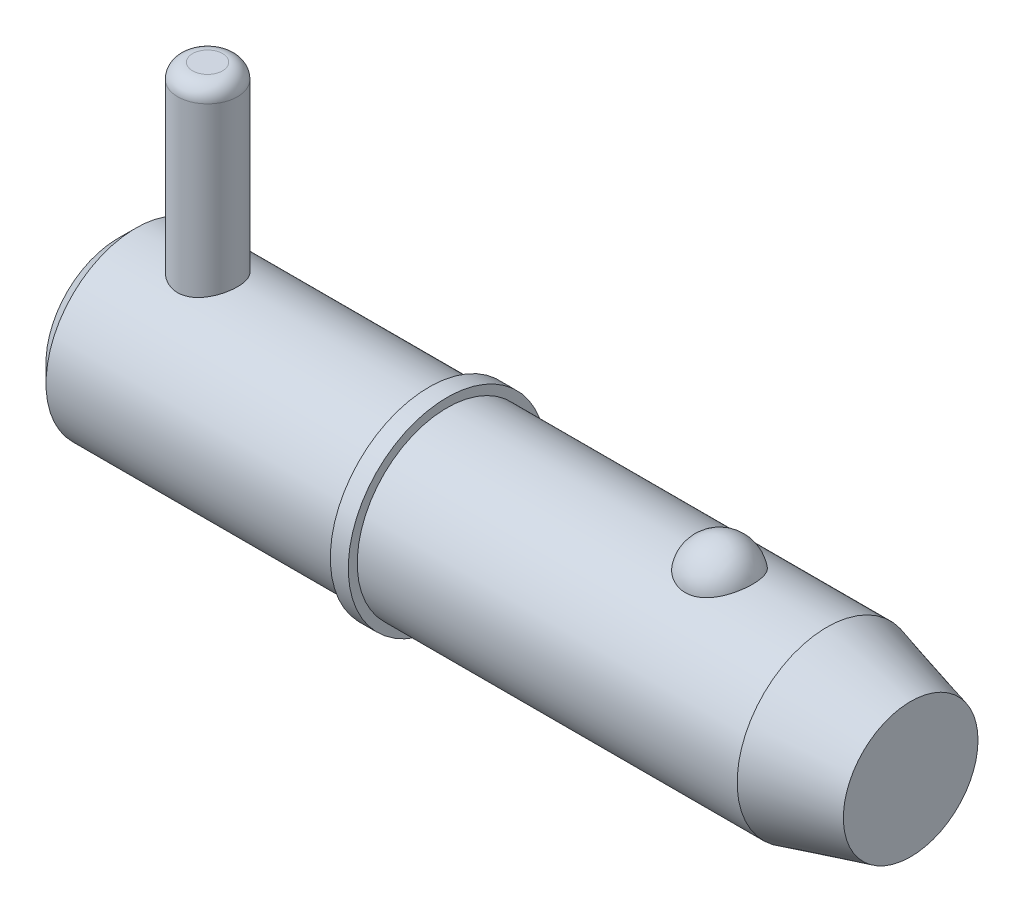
ISO-10303-21;
HEADER;
FILE_DESCRIPTION(('STEP AP214'),'2;1');
FILE_NAME('part.step','',(''),(''),'','','');
FILE_SCHEMA(('AUTOMOTIVE_DESIGN { 1 0 10303 214 1 1 1 1 }'));
ENDSEC;
DATA;
#1=APPLICATION_CONTEXT('core data for automotive mechanical design processes');
#2=APPLICATION_PROTOCOL_DEFINITION('international standard','automotive_design',2000,#1);
#3=PRODUCT_CONTEXT('',#1,'mechanical');
#4=PRODUCT('Part','Part','',(#3));
#5=PRODUCT_RELATED_PRODUCT_CATEGORY('part','',(#4));
#6=PRODUCT_DEFINITION_FORMATION('','',#4);
#7=PRODUCT_DEFINITION_CONTEXT('part definition',#1,'design');
#8=PRODUCT_DEFINITION('design','',#6,#7);
#9=PRODUCT_DEFINITION_SHAPE('','',#8);
#10=(LENGTH_UNIT() NAMED_UNIT(*) SI_UNIT(.MILLI.,.METRE.));
#11=(NAMED_UNIT(*) PLANE_ANGLE_UNIT() SI_UNIT($,.RADIAN.));
#12=(NAMED_UNIT(*) SI_UNIT($,.STERADIAN.) SOLID_ANGLE_UNIT());
#13=UNCERTAINTY_MEASURE_WITH_UNIT(LENGTH_MEASURE(1.E-05),#10,'distance_accuracy_value','');
#14=(GEOMETRIC_REPRESENTATION_CONTEXT(3) GLOBAL_UNCERTAINTY_ASSIGNED_CONTEXT((#13)) GLOBAL_UNIT_ASSIGNED_CONTEXT((#10,
#11,#12)) REPRESENTATION_CONTEXT('',''));
#15=CARTESIAN_POINT('',(0.,0.,0.));
#16=DIRECTION('',(0.,0.,1.));
#17=DIRECTION('',(1.,0.,0.));
#18=AXIS2_PLACEMENT_3D('',#15,#16,#17);
#19=CARTESIAN_POINT('',(9.52500000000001,28.575,0.));
#20=DIRECTION('',(0.,-1.,0.));
#21=DIRECTION('',(0.,0.,-1.));
#22=AXIS2_PLACEMENT_3D('',#19,#20,#21);
#23=CYLINDRICAL_SURFACE('',#22,3.175);
#24=CARTESIAN_POINT('',(9.52500000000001,-7.93750000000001,0.));
#25=DIRECTION('',(0.,1.,0.));
#26=DIRECTION('',(0.,0.,1.));
#27=AXIS2_PLACEMENT_3D('',#24,#25,#26);
#28=CIRCLE('',#27,3.175);
#29=CARTESIAN_POINT('',(9.52500000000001,-7.93750000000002,-3.175));
#30=VERTEX_POINT('',#29);
#31=EDGE_CURVE('P0_E25',#30,#30,#28,.T.);
#32=CARTESIAN_POINT('',(9.52500000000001,26.9875,0.));
#33=DIRECTION('',(0.,1.,0.));
#34=DIRECTION('',(0.,0.,1.));
#35=AXIS2_PLACEMENT_3D('',#32,#33,#34);
#36=CIRCLE('',#35,3.175);
#37=CARTESIAN_POINT('',(9.52500000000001,26.9875,-3.175));
#38=VERTEX_POINT('',#37);
#39=EDGE_CURVE('P0_E29',#38,#38,#36,.F.);
#40=CARTESIAN_POINT('',(9.52500000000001,-7.93750000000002,-3.175));
#41=CARTESIAN_POINT('',(9.52500000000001,-7.57369791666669,-3.175));
#42=CARTESIAN_POINT('',(9.52500000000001,-7.20989583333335,-3.175));
#43=CARTESIAN_POINT('',(9.52500000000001,-6.48229166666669,-3.175));
#44=CARTESIAN_POINT('',(9.52500000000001,-6.11848958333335,-3.175));
#45=CARTESIAN_POINT('',(9.52500000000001,-5.39088541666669,-3.175));
#46=CARTESIAN_POINT('',(9.52500000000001,-5.02708333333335,-3.175));
#47=CARTESIAN_POINT('',(9.52500000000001,-4.29947916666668,-3.175));
#48=CARTESIAN_POINT('',(9.52500000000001,-3.93567708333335,-3.175));
#49=CARTESIAN_POINT('',(9.52500000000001,-3.20807291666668,-3.175));
#50=CARTESIAN_POINT('',(9.52500000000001,-2.84427083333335,-3.175));
#51=CARTESIAN_POINT('',(9.52500000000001,-2.11666666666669,-3.175));
#52=CARTESIAN_POINT('',(9.52500000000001,-1.75286458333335,-3.175));
#53=CARTESIAN_POINT('',(9.52500000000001,-1.02526041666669,-3.175));
#54=CARTESIAN_POINT('',(9.52500000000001,-0.661458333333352,-3.175));
#55=CARTESIAN_POINT('',(9.52500000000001,0.0661458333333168,-3.175));
#56=CARTESIAN_POINT('',(9.52500000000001,0.429947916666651,-3.175));
#57=CARTESIAN_POINT('',(9.52500000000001,1.15755208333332,-3.175));
#58=CARTESIAN_POINT('',(9.52500000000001,1.52135416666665,-3.175));
#59=CARTESIAN_POINT('',(9.52500000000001,2.24895833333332,-3.175));
#60=CARTESIAN_POINT('',(9.52500000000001,2.61276041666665,-3.175));
#61=CARTESIAN_POINT('',(9.52500000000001,3.34036458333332,-3.175));
#62=CARTESIAN_POINT('',(9.52500000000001,3.70416666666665,-3.175));
#63=CARTESIAN_POINT('',(9.52500000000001,4.43177083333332,-3.175));
#64=CARTESIAN_POINT('',(9.52500000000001,4.79557291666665,-3.175));
#65=CARTESIAN_POINT('',(9.52500000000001,5.52317708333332,-3.175));
#66=CARTESIAN_POINT('',(9.52500000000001,5.88697916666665,-3.175));
#67=CARTESIAN_POINT('',(9.52500000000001,6.61458333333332,-3.175));
#68=CARTESIAN_POINT('',(9.52500000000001,6.97838541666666,-3.175));
#69=CARTESIAN_POINT('',(9.52500000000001,7.70598958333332,-3.175));
#70=CARTESIAN_POINT('',(9.52500000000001,8.06979166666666,-3.175));
#71=CARTESIAN_POINT('',(9.52500000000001,8.79739583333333,-3.175));
#72=CARTESIAN_POINT('',(9.52500000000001,9.16119791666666,-3.175));
#73=CARTESIAN_POINT('',(9.52500000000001,9.88880208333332,-3.175));
#74=CARTESIAN_POINT('',(9.52500000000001,10.2526041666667,-3.175));
#75=CARTESIAN_POINT('',(9.52500000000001,10.9802083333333,-3.175));
#76=CARTESIAN_POINT('',(9.52500000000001,11.3440104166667,-3.175));
#77=CARTESIAN_POINT('',(9.52500000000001,12.0716145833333,-3.175));
#78=CARTESIAN_POINT('',(9.52500000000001,12.4354166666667,-3.175));
#79=CARTESIAN_POINT('',(9.52500000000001,13.1630208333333,-3.175));
#80=CARTESIAN_POINT('',(9.52500000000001,13.5268229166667,-3.175));
#81=CARTESIAN_POINT('',(9.52500000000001,14.2544270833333,-3.175));
#82=CARTESIAN_POINT('',(9.52500000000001,14.6182291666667,-3.175));
#83=CARTESIAN_POINT('',(9.52500000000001,15.3458333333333,-3.175));
#84=CARTESIAN_POINT('',(9.52500000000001,15.7096354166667,-3.175));
#85=CARTESIAN_POINT('',(9.52500000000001,16.4372395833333,-3.175));
#86=CARTESIAN_POINT('',(9.52500000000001,16.8010416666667,-3.175));
#87=CARTESIAN_POINT('',(9.52500000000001,17.5286458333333,-3.175));
#88=CARTESIAN_POINT('',(9.52500000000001,17.8924479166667,-3.175));
#89=CARTESIAN_POINT('',(9.52500000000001,18.6200520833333,-3.175));
#90=CARTESIAN_POINT('',(9.52500000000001,18.9838541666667,-3.175));
#91=CARTESIAN_POINT('',(9.52500000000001,19.7114583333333,-3.175));
#92=CARTESIAN_POINT('',(9.52500000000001,20.0752604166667,-3.175));
#93=CARTESIAN_POINT('',(9.52500000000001,20.8028645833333,-3.175));
#94=CARTESIAN_POINT('',(9.52500000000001,21.1666666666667,-3.175));
#95=CARTESIAN_POINT('',(9.52500000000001,21.8942708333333,-3.175));
#96=CARTESIAN_POINT('',(9.52500000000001,22.2580729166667,-3.175));
#97=CARTESIAN_POINT('',(9.52500000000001,22.9856770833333,-3.175));
#98=CARTESIAN_POINT('',(9.52500000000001,23.3494791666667,-3.175));
#99=CARTESIAN_POINT('',(9.52500000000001,24.0770833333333,-3.175));
#100=CARTESIAN_POINT('',(9.52500000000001,24.4408854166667,-3.175));
#101=CARTESIAN_POINT('',(9.52500000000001,25.1684895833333,-3.175));
#102=CARTESIAN_POINT('',(9.52500000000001,25.5322916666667,-3.175));
#103=CARTESIAN_POINT('',(9.52500000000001,26.2598958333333,-3.175));
#104=CARTESIAN_POINT('',(9.52500000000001,26.6236979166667,-3.175));
#105=CARTESIAN_POINT('',(9.52500000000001,26.9875,-3.175));
#106=B_SPLINE_CURVE_WITH_KNOTS('',3,(#40,#41,#42,#43,#44,#45,#46,#47,#48,#49,#50,#51,#52,#53,
#54,#55,#56,#57,#58,#59,#60,#61,#62,#63,#64,#65,#66,#67,#68,#69,#70,#71,#72,#73,#74,#75,#76,#77,
#78,#79,#80,#81,#82,#83,#84,#85,#86,#87,#88,#89,#90,#91,#92,#93,#94,#95,#96,#97,#98,#99,#100,
#101,#102,#103,#104,#105),.UNSPECIFIED.,.F.,.F.,(4,2,2,2,2,2,2,2,2,2,2,2,2,2,2,2,2,2,2,2,2,2,2,
2,2,2,2,2,2,2,2,2,4),(0.,1.09140625,2.1828125,3.27421875,4.365625,5.45703125,6.5484375,
7.63984375,8.73125000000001,9.82265625,10.9140625,12.00546875,13.096875,14.18828125,15.2796875,
16.37109375,17.4625,18.55390625,19.6453125,20.73671875,21.828125,22.91953125,24.0109375,
25.10234375,26.19375,27.28515625,28.3765625,29.46796875,30.559375,31.65078125,32.7421875,
33.83359375,34.925),.UNSPECIFIED.);
#107=EDGE_CURVE('P0_BSEAM14',#30,#38,#106,.T.);
#108=ORIENTED_EDGE('',*,*,#31,.T.);
#109=ORIENTED_EDGE('',*,*,#39,.T.);
#110=ORIENTED_EDGE('',*,*,#107,.T.);
#111=ORIENTED_EDGE('',*,*,#107,.F.);
#112=EDGE_LOOP('',(#108,#110,#109,#111));
#113=FACE_BOUND('',#112,.T.);
#114=ADVANCED_FACE('P0_F14',(#113),#23,.T.);
#115=CARTESIAN_POINT('',(9.52500000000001,28.575,0.));
#116=DIRECTION('',(0.,1.,0.));
#117=DIRECTION('',(0.,0.,1.));
#118=AXIS2_PLACEMENT_3D('',#115,#116,#117);
#119=PLANE('',#118);
#120=CARTESIAN_POINT('',(9.52500000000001,28.575,0.));
#121=DIRECTION('',(0.,1.,0.));
#122=DIRECTION('',(0.,0.,1.));
#123=AXIS2_PLACEMENT_3D('',#120,#121,#122);
#124=CIRCLE('',#123,1.5875);
#125=CARTESIAN_POINT('',(9.52500000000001,28.575,1.5875));
#126=VERTEX_POINT('',#125);
#127=EDGE_CURVE('P0_E10',#126,#126,#124,.T.);
#128=ORIENTED_EDGE('',*,*,#127,.T.);
#129=EDGE_LOOP('',(#128));
#130=FACE_BOUND('',#129,.T.);
#131=ADVANCED_FACE('P0_F46',(#130),#119,.T.);
#132=CARTESIAN_POINT('',(9.52500000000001,-9.525,0.));
#133=DIRECTION('',(0.,1.,0.));
#134=DIRECTION('',(0.,0.,1.));
#135=AXIS2_PLACEMENT_3D('',#132,#133,#134);
#136=PLANE('',#135);
#137=CARTESIAN_POINT('',(9.52500000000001,-9.525,0.));
#138=DIRECTION('',(0.,1.,0.));
#139=DIRECTION('',(0.,0.,1.));
#140=AXIS2_PLACEMENT_3D('',#137,#138,#139);
#141=CIRCLE('',#140,1.5875);
#142=CARTESIAN_POINT('',(9.52500000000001,-9.525,1.5875));
#143=VERTEX_POINT('',#142);
#144=EDGE_CURVE('P0_E21',#143,#143,#141,.F.);
#145=ORIENTED_EDGE('',*,*,#144,.T.);
#146=EDGE_LOOP('',(#145));
#147=FACE_BOUND('',#146,.T.);
#148=ADVANCED_FACE('P0_F43',(#147),#136,.F.);
#149=CARTESIAN_POINT('',(9.52500000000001,-7.9375,0.));
#150=DIRECTION('',(0.,1.,0.));
#151=DIRECTION('',(0.,0.,1.));
#152=AXIS2_PLACEMENT_3D('',#149,#150,#151);
#153=DEGENERATE_TOROIDAL_SURFACE('',#152,1.5875,1.5875,.T.);
#154=ORIENTED_EDGE('',*,*,#144,.F.);
#155=EDGE_LOOP('',(#154));
#156=FACE_BOUND('',#155,.T.);
#157=ORIENTED_EDGE('',*,*,#31,.F.);
#158=EDGE_LOOP('',(#157));
#159=FACE_BOUND('',#158,.T.);
#160=ADVANCED_FACE('P0_F38',(#156,#159),#153,.T.);
#161=CARTESIAN_POINT('',(9.52500000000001,26.9875,0.));
#162=DIRECTION('',(0.,1.,0.));
#163=DIRECTION('',(0.,0.,1.));
#164=AXIS2_PLACEMENT_3D('',#161,#162,#163);
#165=DEGENERATE_TOROIDAL_SURFACE('',#164,1.5875,1.5875,.T.);
#166=ORIENTED_EDGE('',*,*,#39,.F.);
#167=EDGE_LOOP('',(#166));
#168=FACE_BOUND('',#167,.T.);
#169=ORIENTED_EDGE('',*,*,#127,.F.);
#170=EDGE_LOOP('',(#169));
#171=FACE_BOUND('',#170,.T.);
#172=ADVANCED_FACE('P0_F16',(#168,#171),#165,.T.);
#173=CLOSED_SHELL('',(#114,#131,#148,#160,#172));
#174=MANIFOLD_SOLID_BREP('P0_B1',#173);
#175=CARTESIAN_POINT('',(0.,0.,0.));
#176=DIRECTION('',(1.,0.,0.));
#177=DIRECTION('',(0.,0.,-1.));
#178=AXIS2_PLACEMENT_3D('',#175,#176,#177);
#179=CYLINDRICAL_SURFACE('',#178,9.525);
#180=CARTESIAN_POINT('',(75.2430540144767,0.,0.));
#181=DIRECTION('',(1.,0.,0.));
#182=DIRECTION('',(0.,0.,-1.));
#183=AXIS2_PLACEMENT_3D('',#180,#181,#182);
#184=CIRCLE('',#183,9.525);
#185=CARTESIAN_POINT('',(75.2430540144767,0.,-9.525));
#186=VERTEX_POINT('',#185);
#187=EDGE_CURVE('P1_E81',#186,#186,#184,.T.);
#188=ORIENTED_EDGE('',*,*,#187,.F.);
#189=EDGE_LOOP('',(#188));
#190=FACE_BOUND('',#189,.T.);
#191=CARTESIAN_POINT('',(34.93,0.,0.));
#192=DIRECTION('',(1.,0.,0.));
#193=DIRECTION('',(0.,0.,-1.));
#194=AXIS2_PLACEMENT_3D('',#191,#192,#193);
#195=CIRCLE('',#194,9.525);
#196=CARTESIAN_POINT('',(34.93,0.,-9.525));
#197=VERTEX_POINT('',#196);
#198=EDGE_CURVE('P1_E85',#197,#197,#195,.T.);
#199=ORIENTED_EDGE('',*,*,#198,.T.);
#200=EDGE_LOOP('',(#199));
#201=FACE_BOUND('',#200,.T.);
#202=CARTESIAN_POINT('',(63.8457573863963,8.80405803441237,3.63513233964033));
#203=CARTESIAN_POINT('',(63.7516766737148,8.80405953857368,3.6351305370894));
#204=CARTESIAN_POINT('',(63.6575618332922,8.80561325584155,3.63137461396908));
#205=CARTESIAN_POINT('',(63.4700126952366,8.8117774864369,3.61638665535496));
#206=CARTESIAN_POINT('',(63.3765788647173,8.81638992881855,3.60514990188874));
#207=CARTESIAN_POINT('',(63.0979452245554,8.83467114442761,3.56024627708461));
#208=CARTESIAN_POINT('',(62.9146916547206,8.85278327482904,3.51538626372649));
#209=CARTESIAN_POINT('',(62.5595099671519,8.89871214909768,3.39742145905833));
#210=CARTESIAN_POINT('',(62.3875533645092,8.92650327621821,3.32439116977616));
#211=CARTESIAN_POINT('',(62.0587075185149,8.9887481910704,3.15220244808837));
#212=CARTESIAN_POINT('',(61.9018114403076,9.02319893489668,3.05305594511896));
#213=CARTESIAN_POINT('',(61.6022147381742,9.09629186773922,2.82797815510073));
#214=CARTESIAN_POINT('',(61.4600600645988,9.13502685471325,2.70135138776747));
#215=CARTESIAN_POINT('',(61.1982999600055,9.2118657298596,2.42641932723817));
#216=CARTESIAN_POINT('',(61.0787015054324,9.24996941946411,2.27810735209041));
#217=CARTESIAN_POINT('',(60.859645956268,9.32341082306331,1.95652290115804));
#218=CARTESIAN_POINT('',(60.7613174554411,9.35855090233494,1.78243511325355));
#219=CARTESIAN_POINT('',(60.5938190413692,9.42045142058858,1.419372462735));
#220=CARTESIAN_POINT('',(60.5246511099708,9.44721128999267,1.23039658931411));
#221=CARTESIAN_POINT('',(60.4161994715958,9.48990641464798,0.840370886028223));
#222=CARTESIAN_POINT('',(60.3772880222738,9.50570658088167,0.639202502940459));
#223=CARTESIAN_POINT('',(60.3315550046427,9.52433146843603,0.232664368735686));
#224=CARTESIAN_POINT('',(60.3247324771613,9.52715657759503,0.0272947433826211));
#225=CARTESIAN_POINT('',(60.343255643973,9.51956918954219,-0.380478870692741));
#226=CARTESIAN_POINT('',(60.3684052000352,9.50923740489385,-0.582893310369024));
#227=CARTESIAN_POINT('',(60.4500253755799,9.47651897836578,-0.980293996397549));
#228=CARTESIAN_POINT('',(60.5064966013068,9.45413210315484,-1.17528009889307));
#229=CARTESIAN_POINT('',(60.6497192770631,9.39954044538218,-1.55263697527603));
#230=CARTESIAN_POINT('',(60.7365124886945,9.36732213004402,-1.73498993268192));
#231=CARTESIAN_POINT('',(60.9386103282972,9.29640700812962,-2.08177763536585));
#232=CARTESIAN_POINT('',(61.0539172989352,9.25770966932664,-2.24621090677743));
#233=CARTESIAN_POINT('',(61.311264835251,9.17775604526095,-2.55338333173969));
#234=CARTESIAN_POINT('',(61.4534344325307,9.136488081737,-2.69601150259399));
#235=CARTESIAN_POINT('',(61.76089985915,9.05620497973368,-2.95451229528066));
#236=CARTESIAN_POINT('',(61.9261937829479,9.01718965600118,-3.070387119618));
#237=CARTESIAN_POINT('',(62.272052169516,8.94680019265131,-3.26976836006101));
#238=CARTESIAN_POINT('',(62.4522278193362,8.91528408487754,-3.35389750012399));
#239=CARTESIAN_POINT('',(62.8256514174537,8.86272514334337,-3.49043503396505));
#240=CARTESIAN_POINT('',(63.0188944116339,8.84167836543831,-3.54285537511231));
#241=CARTESIAN_POINT('',(63.4025036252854,8.81348056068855,-3.61241306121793));
#242=CARTESIAN_POINT('',(63.5925251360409,8.80568348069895,-3.63119339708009));
#243=CARTESIAN_POINT('',(63.9731906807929,8.80289410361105,-3.63795342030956));
#244=CARTESIAN_POINT('',(64.1638345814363,8.80789922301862,-3.62593932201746));
#245=CARTESIAN_POINT('',(64.534007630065,8.82974915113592,-3.57238430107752));
#246=CARTESIAN_POINT('',(64.7136976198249,8.84621463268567,-3.53178890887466));
#247=CARTESIAN_POINT('',(65.063422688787,8.88875330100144,-3.42331083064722));
#248=CARTESIAN_POINT('',(65.2334569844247,8.91482726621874,-3.35542593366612));
#249=CARTESIAN_POINT('',(65.5632377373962,8.97448239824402,-3.19248225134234));
#250=CARTESIAN_POINT('',(65.7226801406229,9.0082144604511,-3.09686474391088));
#251=CARTESIAN_POINT('',(66.0235136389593,9.07935398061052,-2.88162736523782));
#252=CARTESIAN_POINT('',(66.1649005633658,9.11676228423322,-2.76200196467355));
#253=CARTESIAN_POINT('',(66.4333193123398,9.19347419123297,-2.49516285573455));
#254=CARTESIAN_POINT('',(66.5592750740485,9.23277872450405,-2.34686614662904));
#255=CARTESIAN_POINT('',(66.7855227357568,9.3073761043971,-2.03093683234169));
#256=CARTESIAN_POINT('',(66.8858100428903,9.34266823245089,-1.86330077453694));
#257=CARTESIAN_POINT('',(67.0615149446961,9.40674710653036,-1.50744893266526));
#258=CARTESIAN_POINT('',(67.136041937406,9.43529176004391,-1.31874876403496));
#259=CARTESIAN_POINT('',(67.2541650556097,9.48144132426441,-0.930631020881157));
#260=CARTESIAN_POINT('',(67.2977608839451,9.49904612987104,-0.731213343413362));
#261=CARTESIAN_POINT('',(67.3531580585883,9.5215314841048,-0.327147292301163));
#262=CARTESIAN_POINT('',(67.3649354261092,9.52640243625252,-0.122495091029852));
#263=CARTESIAN_POINT('',(67.3563825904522,9.5228957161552,0.28601848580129));
#264=CARTESIAN_POINT('',(67.3360530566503,9.5145183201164,0.489879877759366));
#265=CARTESIAN_POINT('',(67.2638840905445,9.48544083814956,0.889994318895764));
#266=CARTESIAN_POINT('',(67.2121993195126,9.46480124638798,1.08627971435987));
#267=CARTESIAN_POINT('',(67.0784917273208,9.41333895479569,1.46682086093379));
#268=CARTESIAN_POINT('',(66.9964668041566,9.38251554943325,1.65107577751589));
#269=CARTESIAN_POINT('',(66.8031929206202,9.31365636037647,2.00346348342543));
#270=CARTESIAN_POINT('',(66.6917838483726,9.27558138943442,2.17150083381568));
#271=CARTESIAN_POINT('',(66.4422947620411,9.19638714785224,2.48563115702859));
#272=CARTESIAN_POINT('',(66.3042163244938,9.15526805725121,2.63172542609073));
#273=CARTESIAN_POINT('',(66.0048438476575,9.07465393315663,2.89750997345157));
#274=CARTESIAN_POINT('',(65.8436109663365,9.03515496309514,3.01726776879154));
#275=CARTESIAN_POINT('',(65.5016136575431,8.96227564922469,3.22732920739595));
#276=CARTESIAN_POINT('',(65.3208418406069,8.92889763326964,3.31762165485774));
#277=CARTESIAN_POINT('',(64.9514451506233,8.8734538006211,3.46314419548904));
#278=CARTESIAN_POINT('',(64.7633237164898,8.85102983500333,3.51950082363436));
#279=CARTESIAN_POINT('',(64.4757869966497,8.8266696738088,3.57993683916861));
#280=CARTESIAN_POINT('',(64.3791339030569,8.82009725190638,3.59606217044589));
#281=CARTESIAN_POINT('',(64.1846770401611,8.81020897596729,3.62022512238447));
#282=CARTESIAN_POINT('',(64.0868741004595,8.80689090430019,3.62826825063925));
#283=CARTESIAN_POINT('',(63.9412243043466,8.80445615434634,3.6341676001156));
#284=CARTESIAN_POINT('',(63.8934952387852,8.80405727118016,3.63513325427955));
#285=CARTESIAN_POINT('',(63.8457573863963,8.80405803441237,3.63513233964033));
#286=B_SPLINE_CURVE_WITH_KNOTS('',3,(#202,#203,#204,#205,#206,#207,#208,#209,#210,#211,#212,
#213,#214,#215,#216,#217,#218,#219,#220,#221,#222,#223,#224,#225,#226,#227,#228,#229,#230,#231,
#232,#233,#234,#235,#236,#237,#238,#239,#240,#241,#242,#243,#244,#245,#246,#247,#248,#249,#250,
#251,#252,#253,#254,#255,#256,#257,#258,#259,#260,#261,#262,#263,#264,#265,#266,#267,#268,#269,
#270,#271,#272,#273,#274,#275,#276,#277,#278,#279,#280,#281,#282,#283,#284,#285),.UNSPECIFIED.,
.T.,.F.,(4,2,2,2,2,2,2,2,2,2,2,2,2,2,2,2,2,2,2,2,2,2,2,2,2,2,2,2,2,2,2,2,2,2,2,2,2,2,2,2,2,4),
(0.,0.282202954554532,0.564584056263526,1.13017050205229,1.69427128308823,2.25811483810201,
2.83836627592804,3.4187968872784,4.0249711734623,4.63118665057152,5.24474754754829,
5.85829010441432,6.46808687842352,7.07789545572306,7.68854723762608,8.29924920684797,
8.91296283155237,9.5266259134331,10.1275338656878,10.7282152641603,11.2986646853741,
11.8689989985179,12.4213015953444,12.973648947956,13.5380053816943,14.1024919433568,
14.6952986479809,15.2882113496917,15.8999469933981,16.5116885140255,17.1238909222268,
17.7360805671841,18.3452748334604,18.9545113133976,19.5671386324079,20.179729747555,
20.7907316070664,21.4019653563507,21.9915938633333,22.2859053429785,22.5800161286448,
22.7232098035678),.UNSPECIFIED.);
#287=CARTESIAN_POINT('',(63.8457573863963,8.80405803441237,3.63513233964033));
#288=VERTEX_POINT('',#287);
#289=EDGE_CURVE('P1_E35',#288,#288,#286,.T.);
#290=ORIENTED_EDGE('',*,*,#289,.T.);
#291=EDGE_LOOP('',(#290));
#292=FACE_BOUND('',#291,.T.);
#293=ADVANCED_FACE('P1_F13',(#190,#201,#292),#179,.T.);
#294=CARTESIAN_POINT('',(0.,0.,0.));
#295=DIRECTION('',(-1.,0.,0.));
#296=DIRECTION('',(0.,0.,1.));
#297=AXIS2_PLACEMENT_3D('',#294,#295,#296);
#298=PLANE('',#297);
#299=CARTESIAN_POINT('',(0.,0.,0.));
#300=DIRECTION('',(1.,0.,0.));
#301=DIRECTION('',(0.,0.,-1.));
#302=AXIS2_PLACEMENT_3D('',#299,#300,#301);
#303=CIRCLE('',#302,7.62);
#304=CARTESIAN_POINT('',(0.,0.,-7.62));
#305=VERTEX_POINT('',#304);
#306=EDGE_CURVE('P1_E9',#305,#305,#303,.T.);
#307=ORIENTED_EDGE('',*,*,#306,.F.);
#308=EDGE_LOOP('',(#307));
#309=FACE_BOUND('',#308,.T.);
#310=ADVANCED_FACE('P1_F15',(#309),#298,.T.);
#311=CARTESIAN_POINT('',(1.90499999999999,0.,0.));
#312=DIRECTION('',(1.,0.,0.));
#313=DIRECTION('',(0.,0.,-1.));
#314=AXIS2_PLACEMENT_3D('',#311,#312,#313);
#315=CONICAL_SURFACE('',#314,9.525,0.785398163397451);
#316=ORIENTED_EDGE('',*,*,#306,.T.);
#317=EDGE_LOOP('',(#316));
#318=FACE_BOUND('',#317,.T.);
#319=CARTESIAN_POINT('',(1.90499999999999,0.,0.));
#320=DIRECTION('',(1.,0.,0.));
#321=DIRECTION('',(0.,0.,-1.));
#322=AXIS2_PLACEMENT_3D('',#319,#320,#321);
#323=CIRCLE('',#322,9.525);
#324=CARTESIAN_POINT('',(1.90499999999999,0.,-9.525));
#325=VERTEX_POINT('',#324);
#326=EDGE_CURVE('P1_E26',#325,#325,#323,.T.);
#327=ORIENTED_EDGE('',*,*,#326,.F.);
#328=EDGE_LOOP('',(#327));
#329=FACE_BOUND('',#328,.T.);
#330=ADVANCED_FACE('P1_F77',(#318,#329),#315,.T.);
#331=CARTESIAN_POINT('',(0.,0.,0.));
#332=DIRECTION('',(1.,0.,0.));
#333=DIRECTION('',(0.,0.,-1.));
#334=AXIS2_PLACEMENT_3D('',#331,#332,#333);
#335=CYLINDRICAL_SURFACE('',#334,9.525);
#336=CARTESIAN_POINT('',(9.525,-8.98025612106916,3.175));
#337=CARTESIAN_POINT('',(9.35206354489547,-8.98025555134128,3.17500081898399));
#338=CARTESIAN_POINT('',(9.17913201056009,-8.98530617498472,3.16082293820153));
#339=CARTESIAN_POINT('',(8.83839221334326,-9.00485797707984,3.10467734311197));
#340=CARTESIAN_POINT('',(8.67058479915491,-9.0193607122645,3.06270505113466));
#341=CARTESIAN_POINT('',(8.34508461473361,-9.05599546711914,2.95260866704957));
#342=CARTESIAN_POINT('',(8.18737272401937,-9.07811252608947,2.88453582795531));
#343=CARTESIAN_POINT('',(7.88555684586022,-9.12746212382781,2.72434567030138));
#344=CARTESIAN_POINT('',(7.74145587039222,-9.1546957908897,2.63222304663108));
#345=CARTESIAN_POINT('',(7.46531411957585,-9.21240503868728,2.42268738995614));
#346=CARTESIAN_POINT('',(7.33388351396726,-9.24296141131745,2.30449228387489));
#347=CARTESIAN_POINT('',(7.09229340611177,-9.30319020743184,2.0478358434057));
#348=CARTESIAN_POINT('',(6.98213731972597,-9.33286248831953,1.90937126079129));
#349=CARTESIAN_POINT('',(6.78345450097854,-9.38891527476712,1.61164431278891));
#350=CARTESIAN_POINT('',(6.69556709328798,-9.41518969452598,1.45193356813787));
#351=CARTESIAN_POINT('',(6.54814671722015,-9.46053437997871,1.11896913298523));
#352=CARTESIAN_POINT('',(6.48860610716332,-9.47960658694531,0.945719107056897));
#353=CARTESIAN_POINT('',(6.40163866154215,-9.50782564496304,0.596991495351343));
#354=CARTESIAN_POINT('',(6.373166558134,-9.5172947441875,0.421801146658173));
#355=CARTESIAN_POINT('',(6.3458207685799,-9.52638456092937,0.068890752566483));
#356=CARTESIAN_POINT('',(6.34693945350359,-9.52600781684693,-0.108828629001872));
#357=CARTESIAN_POINT('',(6.37808050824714,-9.51566675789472,-0.454353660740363));
#358=CARTESIAN_POINT('',(6.4069675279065,-9.50607905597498,-0.622274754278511));
#359=CARTESIAN_POINT('',(6.490947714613,-9.47886621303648,-0.950732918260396));
#360=CARTESIAN_POINT('',(6.54604265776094,-9.46124052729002,-1.11126948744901));
#361=CARTESIAN_POINT('',(6.68153768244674,-9.41945253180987,-1.42288410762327));
#362=CARTESIAN_POINT('',(6.76226085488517,-9.3952073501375,-1.57381010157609));
#363=CARTESIAN_POINT('',(6.94645456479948,-9.34270397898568,-1.86030973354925));
#364=CARTESIAN_POINT('',(7.04993142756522,-9.31444467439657,-1.99587908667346));
#365=CARTESIAN_POINT('',(7.28241619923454,-9.25532159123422,-2.2545702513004));
#366=CARTESIAN_POINT('',(7.4123967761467,-9.22439783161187,-2.37680549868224));
#367=CARTESIAN_POINT('',(7.69127470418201,-9.1645528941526,-2.5980302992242));
#368=CARTESIAN_POINT('',(7.84017496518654,-9.13563202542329,-2.6970162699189));
#369=CARTESIAN_POINT('',(8.15547526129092,-9.08273917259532,-2.87016016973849));
#370=CARTESIAN_POINT('',(8.32209451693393,-9.05884361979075,-2.94394402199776));
#371=CARTESIAN_POINT('',(8.66638917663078,-9.01959241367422,-3.06210713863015));
#372=CARTESIAN_POINT('',(8.84405991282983,-9.00423318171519,-3.10649872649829));
#373=CARTESIAN_POINT('',(9.19682677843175,-8.98460345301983,-3.16281207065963));
#374=CARTESIAN_POINT('',(9.37167742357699,-8.9798639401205,-3.17610837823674));
#375=CARTESIAN_POINT('',(9.72113927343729,-8.9806993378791,-3.17374726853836));
#376=CARTESIAN_POINT('',(9.89575051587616,-8.98627237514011,-3.15809511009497));
#377=CARTESIAN_POINT('',(10.2335233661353,-9.00663737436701,-3.09951644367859));
#378=CARTESIAN_POINT('',(10.3968722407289,-9.02110608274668,-3.05754530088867));
#379=CARTESIAN_POINT('',(10.7141759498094,-9.05727657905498,-2.94866651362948));
#380=CARTESIAN_POINT('',(10.8681291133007,-9.07897964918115,-2.88175444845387));
#381=CARTESIAN_POINT('',(11.1676828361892,-9.12802586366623,-2.72248103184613));
#382=CARTESIAN_POINT('',(11.3128635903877,-9.1555260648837,-2.62937980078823));
#383=CARTESIAN_POINT('',(11.5860387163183,-9.21276315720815,-2.42120937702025));
#384=CARTESIAN_POINT('',(11.7140280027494,-9.24250070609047,-2.30613370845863));
#385=CARTESIAN_POINT('',(11.9555513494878,-9.30259247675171,-2.05070616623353));
#386=CARTESIAN_POINT('',(12.0680936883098,-9.33290753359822,-1.90940458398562));
#387=CARTESIAN_POINT('',(12.267933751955,-9.3893275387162,-1.60917665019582));
#388=CARTESIAN_POINT('',(12.3552323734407,-9.41543263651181,-1.45025092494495));
#389=CARTESIAN_POINT('',(12.5013088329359,-9.46036988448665,-1.12007606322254));
#390=CARTESIAN_POINT('',(12.5602723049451,-9.47924920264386,-0.9489158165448));
#391=CARTESIAN_POINT('',(12.6483355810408,-9.50781089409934,-0.598355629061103));
#392=CARTESIAN_POINT('',(12.6774461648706,-9.5174965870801,-0.4189586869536));
#393=CARTESIAN_POINT('',(12.7040070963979,-9.52632915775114,-0.066088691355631));
#394=CARTESIAN_POINT('',(12.7028811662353,-9.52594996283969,0.107266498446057));
#395=CARTESIAN_POINT('',(12.6725130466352,-9.51586223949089,0.451202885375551));
#396=CARTESIAN_POINT('',(12.643273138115,-9.50615446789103,0.621784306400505));
#397=CARTESIAN_POINT('',(12.5584514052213,-9.47867404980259,0.952633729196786));
#398=CARTESIAN_POINT('',(12.5032953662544,-9.46103195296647,1.1130225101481));
#399=CARTESIAN_POINT('',(12.3686013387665,-9.41949985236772,1.42233126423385));
#400=CARTESIAN_POINT('',(12.2890589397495,-9.39560871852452,1.57124915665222));
#401=CARTESIAN_POINT('',(12.1044667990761,-9.34294133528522,1.85938800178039));
#402=CARTESIAN_POINT('',(11.9985831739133,-9.31401720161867,1.9980473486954));
#403=CARTESIAN_POINT('',(11.7657327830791,-9.25490239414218,2.25609475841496));
#404=CARTESIAN_POINT('',(11.6387592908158,-9.22471131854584,2.37547664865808));
#405=CARTESIAN_POINT('',(11.3613902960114,-9.16505913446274,2.59633024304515));
#406=CARTESIAN_POINT('',(11.2102725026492,-9.13567286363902,2.69691791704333));
#407=CARTESIAN_POINT('',(10.8923631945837,-9.08241113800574,2.87119803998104));
#408=CARTESIAN_POINT('',(10.7255757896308,-9.05853424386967,2.94489751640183));
#409=CARTESIAN_POINT('',(10.3887212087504,-9.02021736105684,3.06020415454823));
#410=CARTESIAN_POINT('',(10.219143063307,-9.00539959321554,3.10311136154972));
#411=CARTESIAN_POINT('',(9.87470703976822,-8.98542092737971,3.16050396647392));
#412=CARTESIAN_POINT('',(9.699851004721,-8.98025669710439,3.17499917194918));
#413=CARTESIAN_POINT('',(9.525,-8.98025612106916,3.175));
#414=B_SPLINE_CURVE_WITH_KNOTS('',3,(#336,#337,#338,#339,#340,#341,#342,#343,#344,#345,#346,
#347,#348,#349,#350,#351,#352,#353,#354,#355,#356,#357,#358,#359,#360,#361,#362,#363,#364,#365,
#366,#367,#368,#369,#370,#371,#372,#373,#374,#375,#376,#377,#378,#379,#380,#381,#382,#383,#384,
#385,#386,#387,#388,#389,#390,#391,#392,#393,#394,#395,#396,#397,#398,#399,#400,#401,#402,#403,
#404,#405,#406,#407,#408,#409,#410,#411,#412,#413),.UNSPECIFIED.,.T.,.F.,(4,2,2,2,2,2,2,2,2,2,2,
2,2,2,2,2,2,2,2,2,2,2,2,2,2,2,2,2,2,2,2,2,2,2,2,2,2,2,4),(0.,0.518161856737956,1.03640907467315,
1.55364379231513,2.07099270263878,2.60671746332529,3.14252816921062,3.69231882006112,
4.24196117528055,4.77247962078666,5.30286129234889,5.81244090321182,6.32205505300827,
6.83836754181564,7.3548237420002,7.89559553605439,8.43645060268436,8.98501631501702,
9.53335188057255,10.056948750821,10.5804505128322,11.0859695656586,11.5915782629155,
12.1132237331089,12.6350231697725,13.1819271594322,13.7288117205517,14.2720628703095,
14.815117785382,15.3326491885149,15.8501386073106,16.3594083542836,16.868770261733,
17.3969527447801,17.925304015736,18.4743376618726,19.023227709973,19.5473069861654,
20.0712053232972),.UNSPECIFIED.);
#415=CARTESIAN_POINT('',(9.525,-8.98025612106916,3.175));
#416=VERTEX_POINT('',#415);
#417=EDGE_CURVE('P1_E17',#416,#416,#414,.T.);
#418=ORIENTED_EDGE('',*,*,#417,.F.);
#419=EDGE_LOOP('',(#418));
#420=FACE_BOUND('',#419,.T.);
#421=CARTESIAN_POINT('',(9.525,8.98025612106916,3.175));
#422=CARTESIAN_POINT('',(9.69793645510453,8.98025555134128,3.17500081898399));
#423=CARTESIAN_POINT('',(9.87086798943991,8.98530617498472,3.16082293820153));
#424=CARTESIAN_POINT('',(10.2116077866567,9.00485797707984,3.10467734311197));
#425=CARTESIAN_POINT('',(10.3794152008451,9.0193607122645,3.06270505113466));
#426=CARTESIAN_POINT('',(10.7049153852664,9.05599546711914,2.95260866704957));
#427=CARTESIAN_POINT('',(10.8626272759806,9.07811252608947,2.88453582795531));
#428=CARTESIAN_POINT('',(11.1644431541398,9.12746212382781,2.72434567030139));
#429=CARTESIAN_POINT('',(11.3085441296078,9.15469579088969,2.63222304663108));
#430=CARTESIAN_POINT('',(11.5846858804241,9.21240503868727,2.42268738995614));
#431=CARTESIAN_POINT('',(11.7161164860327,9.24296141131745,2.30449228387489));
#432=CARTESIAN_POINT('',(11.9577065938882,9.30319020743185,2.0478358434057));
#433=CARTESIAN_POINT('',(12.067862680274,9.33286248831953,1.90937126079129));
#434=CARTESIAN_POINT('',(12.2665454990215,9.38891527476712,1.61164431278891));
#435=CARTESIAN_POINT('',(12.354432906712,9.41518969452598,1.45193356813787));
#436=CARTESIAN_POINT('',(12.5018532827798,9.46053437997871,1.11896913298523));
#437=CARTESIAN_POINT('',(12.5613938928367,9.47960658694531,0.945719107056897));
#438=CARTESIAN_POINT('',(12.6483613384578,9.50782564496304,0.596991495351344));
#439=CARTESIAN_POINT('',(12.676833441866,9.5172947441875,0.421801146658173));
#440=CARTESIAN_POINT('',(12.7041792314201,9.52638456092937,0.0688907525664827));
#441=CARTESIAN_POINT('',(12.7030605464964,9.52600781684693,-0.108828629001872));
#442=CARTESIAN_POINT('',(12.6719194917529,9.51566675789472,-0.454353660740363));
#443=CARTESIAN_POINT('',(12.6430324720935,9.50607905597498,-0.622274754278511));
#444=CARTESIAN_POINT('',(12.559052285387,9.47886621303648,-0.950732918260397));
#445=CARTESIAN_POINT('',(12.5039573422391,9.46124052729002,-1.11126948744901));
#446=CARTESIAN_POINT('',(12.3684623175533,9.41945253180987,-1.42288410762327));
#447=CARTESIAN_POINT('',(12.2877391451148,9.3952073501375,-1.57381010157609));
#448=CARTESIAN_POINT('',(12.1035454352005,9.34270397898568,-1.86030973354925));
#449=CARTESIAN_POINT('',(12.0000685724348,9.31444467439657,-1.99587908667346));
#450=CARTESIAN_POINT('',(11.7675838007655,9.25532159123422,-2.2545702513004));
#451=CARTESIAN_POINT('',(11.6376032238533,9.22439783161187,-2.37680549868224));
#452=CARTESIAN_POINT('',(11.358725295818,9.1645528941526,-2.5980302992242));
#453=CARTESIAN_POINT('',(11.2098250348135,9.13563202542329,-2.6970162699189));
#454=CARTESIAN_POINT('',(10.8945247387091,9.08273917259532,-2.87016016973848));
#455=CARTESIAN_POINT('',(10.7279054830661,9.05884361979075,-2.94394402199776));
#456=CARTESIAN_POINT('',(10.3836108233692,9.01959241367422,-3.06210713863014));
#457=CARTESIAN_POINT('',(10.2059400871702,9.00423318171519,-3.10649872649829));
#458=CARTESIAN_POINT('',(9.85317322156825,8.98460345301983,-3.16281207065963));
#459=CARTESIAN_POINT('',(9.67832257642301,8.9798639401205,-3.17610837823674));
#460=CARTESIAN_POINT('',(9.32886072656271,8.9806993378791,-3.17374726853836));
#461=CARTESIAN_POINT('',(9.15424948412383,8.98627237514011,-3.15809511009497));
#462=CARTESIAN_POINT('',(8.81647663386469,9.00663737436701,-3.09951644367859));
#463=CARTESIAN_POINT('',(8.65312775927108,9.02110608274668,-3.05754530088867));
#464=CARTESIAN_POINT('',(8.33582405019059,9.05727657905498,-2.94866651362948));
#465=CARTESIAN_POINT('',(8.18187088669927,9.07897964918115,-2.88175444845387));
#466=CARTESIAN_POINT('',(7.88231716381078,9.12802586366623,-2.72248103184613));
#467=CARTESIAN_POINT('',(7.73713640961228,9.1555260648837,-2.62937980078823));
#468=CARTESIAN_POINT('',(7.46396128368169,9.21276315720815,-2.42120937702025));
#469=CARTESIAN_POINT('',(7.33597199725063,9.24250070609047,-2.30613370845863));
#470=CARTESIAN_POINT('',(7.09444865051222,9.30259247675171,-2.05070616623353));
#471=CARTESIAN_POINT('',(6.98190631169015,9.33290753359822,-1.90940458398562));
#472=CARTESIAN_POINT('',(6.78206624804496,9.3893275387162,-1.60917665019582));
#473=CARTESIAN_POINT('',(6.6947676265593,9.41543263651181,-1.45025092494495));
#474=CARTESIAN_POINT('',(6.54869116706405,9.46036988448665,-1.12007606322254));
#475=CARTESIAN_POINT('',(6.48972769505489,9.47924920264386,-0.948915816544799));
#476=CARTESIAN_POINT('',(6.40166441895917,9.50781089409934,-0.598355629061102));
#477=CARTESIAN_POINT('',(6.3725538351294,9.5174965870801,-0.418958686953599));
#478=CARTESIAN_POINT('',(6.34599290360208,9.52632915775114,-0.0660886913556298));
#479=CARTESIAN_POINT('',(6.3471188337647,9.52594996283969,0.107266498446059));
#480=CARTESIAN_POINT('',(6.37748695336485,9.51586223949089,0.451202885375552));
#481=CARTESIAN_POINT('',(6.40672686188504,9.50615446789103,0.621784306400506));
#482=CARTESIAN_POINT('',(6.49154859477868,9.47867404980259,0.952633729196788));
#483=CARTESIAN_POINT('',(6.54670463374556,9.46103195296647,1.11302251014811));
#484=CARTESIAN_POINT('',(6.68139866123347,9.41949985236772,1.42233126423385));
#485=CARTESIAN_POINT('',(6.76094106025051,9.39560871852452,1.57124915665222));
#486=CARTESIAN_POINT('',(6.94553320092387,9.34294133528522,1.85938800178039));
#487=CARTESIAN_POINT('',(7.05141682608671,9.31401720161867,1.9980473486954));
#488=CARTESIAN_POINT('',(7.28426721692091,9.25490239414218,2.25609475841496));
#489=CARTESIAN_POINT('',(7.41124070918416,9.22471131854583,2.37547664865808));
#490=CARTESIAN_POINT('',(7.68860970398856,9.16505913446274,2.59633024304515));
#491=CARTESIAN_POINT('',(7.83972749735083,9.13567286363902,2.69691791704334));
#492=CARTESIAN_POINT('',(8.15763680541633,9.08241113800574,2.87119803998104));
#493=CARTESIAN_POINT('',(8.32442421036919,9.05853424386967,2.94489751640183));
#494=CARTESIAN_POINT('',(8.66127879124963,9.02021736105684,3.06020415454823));
#495=CARTESIAN_POINT('',(8.83085693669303,9.00539959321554,3.10311136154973));
#496=CARTESIAN_POINT('',(9.17529296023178,8.98542092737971,3.16050396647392));
#497=CARTESIAN_POINT('',(9.350148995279,8.98025669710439,3.17499917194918));
#498=CARTESIAN_POINT('',(9.525,8.98025612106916,3.175));
#499=B_SPLINE_CURVE_WITH_KNOTS('',3,(#421,#422,#423,#424,#425,#426,#427,#428,#429,#430,#431,
#432,#433,#434,#435,#436,#437,#438,#439,#440,#441,#442,#443,#444,#445,#446,#447,#448,#449,#450,
#451,#452,#453,#454,#455,#456,#457,#458,#459,#460,#461,#462,#463,#464,#465,#466,#467,#468,#469,
#470,#471,#472,#473,#474,#475,#476,#477,#478,#479,#480,#481,#482,#483,#484,#485,#486,#487,#488,
#489,#490,#491,#492,#493,#494,#495,#496,#497,#498),.UNSPECIFIED.,.T.,.F.,(4,2,2,2,2,2,2,2,2,2,2,
2,2,2,2,2,2,2,2,2,2,2,2,2,2,2,2,2,2,2,2,2,2,2,2,2,2,2,4),(0.,0.518161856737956,1.03640907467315,
1.55364379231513,2.07099270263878,2.60671746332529,3.14252816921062,3.69231882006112,
4.24196117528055,4.77247962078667,5.30286129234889,5.81244090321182,6.32205505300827,
6.83836754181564,7.3548237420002,7.89559553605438,8.43645060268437,8.98501631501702,
9.53335188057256,10.056948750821,10.5804505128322,11.0859695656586,11.5915782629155,
12.1132237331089,12.6350231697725,13.1819271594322,13.7288117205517,14.2720628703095,
14.815117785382,15.3326491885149,15.8501386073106,16.3594083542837,16.868770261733,
17.3969527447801,17.9253040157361,18.4743376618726,19.023227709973,19.5473069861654,
20.0712053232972),.UNSPECIFIED.);
#500=CARTESIAN_POINT('',(9.525,8.98025612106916,3.175));
#501=VERTEX_POINT('',#500);
#502=EDGE_CURVE('P1_E43',#501,#501,#499,.T.);
#503=ORIENTED_EDGE('',*,*,#502,.F.);
#504=EDGE_LOOP('',(#503));
#505=FACE_BOUND('',#504,.T.);
#506=ORIENTED_EDGE('',*,*,#326,.T.);
#507=EDGE_LOOP('',(#506));
#508=FACE_BOUND('',#507,.T.);
#509=CARTESIAN_POINT('',(33.025,0.,0.));
#510=DIRECTION('',(1.,0.,0.));
#511=DIRECTION('',(0.,0.,-1.));
#512=AXIS2_PLACEMENT_3D('',#509,#510,#511);
#513=CIRCLE('',#512,9.525);
#514=CARTESIAN_POINT('',(33.025,0.,-9.525));
#515=VERTEX_POINT('',#514);
#516=EDGE_CURVE('P1_E31',#515,#515,#513,.T.);
#517=ORIENTED_EDGE('',*,*,#516,.F.);
#518=EDGE_LOOP('',(#517));
#519=FACE_BOUND('',#518,.T.);
#520=ADVANCED_FACE('P1_F103',(#420,#505,#508,#519),#335,.T.);
#521=CARTESIAN_POINT('',(33.025,9.525,0.));
#522=DIRECTION('',(-1.,0.,0.));
#523=DIRECTION('',(0.,0.,1.));
#524=AXIS2_PLACEMENT_3D('',#521,#522,#523);
#525=PLANE('',#524);
#526=ORIENTED_EDGE('',*,*,#516,.T.);
#527=EDGE_LOOP('',(#526));
#528=FACE_BOUND('',#527,.T.);
#529=CARTESIAN_POINT('',(33.025,0.,0.));
#530=DIRECTION('',(1.,0.,0.));
#531=DIRECTION('',(0.,0.,-1.));
#532=AXIS2_PLACEMENT_3D('',#529,#530,#531);
#533=CIRCLE('',#532,10.4775);
#534=CARTESIAN_POINT('',(33.025,0.,-10.4775));
#535=VERTEX_POINT('',#534);
#536=EDGE_CURVE('P1_E91',#535,#535,#533,.T.);
#537=ORIENTED_EDGE('',*,*,#536,.F.);
#538=EDGE_LOOP('',(#537));
#539=FACE_BOUND('',#538,.T.);
#540=ADVANCED_FACE('P1_F100',(#528,#539),#525,.T.);
#541=CARTESIAN_POINT('',(0.,0.,0.));
#542=DIRECTION('',(1.,0.,0.));
#543=DIRECTION('',(0.,0.,-1.));
#544=AXIS2_PLACEMENT_3D('',#541,#542,#543);
#545=CYLINDRICAL_SURFACE('',#544,10.4775);
#546=ORIENTED_EDGE('',*,*,#536,.T.);
#547=EDGE_LOOP('',(#546));
#548=FACE_BOUND('',#547,.T.);
#549=CARTESIAN_POINT('',(34.93,0.,0.));
#550=DIRECTION('',(1.,0.,0.));
#551=DIRECTION('',(0.,0.,-1.));
#552=AXIS2_PLACEMENT_3D('',#549,#550,#551);
#553=CIRCLE('',#552,10.4775);
#554=CARTESIAN_POINT('',(34.93,0.,-10.4775));
#555=VERTEX_POINT('',#554);
#556=EDGE_CURVE('P1_E88',#555,#555,#553,.T.);
#557=ORIENTED_EDGE('',*,*,#556,.F.);
#558=EDGE_LOOP('',(#557));
#559=FACE_BOUND('',#558,.T.);
#560=ADVANCED_FACE('P1_F68',(#548,#559),#545,.T.);
#561=CARTESIAN_POINT('',(34.93,10.4775,0.));
#562=DIRECTION('',(1.,0.,0.));
#563=DIRECTION('',(0.,0.,-1.));
#564=AXIS2_PLACEMENT_3D('',#561,#562,#563);
#565=PLANE('',#564);
#566=ORIENTED_EDGE('',*,*,#556,.T.);
#567=EDGE_LOOP('',(#566));
#568=FACE_BOUND('',#567,.T.);
#569=ORIENTED_EDGE('',*,*,#198,.F.);
#570=EDGE_LOOP('',(#569));
#571=FACE_BOUND('',#570,.T.);
#572=ADVANCED_FACE('P1_F62',(#568,#571),#565,.T.);
#573=CARTESIAN_POINT('',(84.13,0.,0.));
#574=DIRECTION('',(-1.,0.,0.));
#575=DIRECTION('',(0.,0.,1.));
#576=AXIS2_PLACEMENT_3D('',#573,#574,#575);
#577=CONICAL_SURFACE('',#576,7.14375000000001,0.26179938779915);
#578=ORIENTED_EDGE('',*,*,#187,.T.);
#579=EDGE_LOOP('',(#578));
#580=FACE_BOUND('',#579,.T.);
#581=CARTESIAN_POINT('',(84.13,0.,0.));
#582=DIRECTION('',(1.,0.,0.));
#583=DIRECTION('',(0.,0.,-1.));
#584=AXIS2_PLACEMENT_3D('',#581,#582,#583);
#585=CIRCLE('',#584,7.14375000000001);
#586=CARTESIAN_POINT('',(84.13,0.,-7.14375000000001));
#587=VERTEX_POINT('',#586);
#588=EDGE_CURVE('P1_E42',#587,#587,#585,.T.);
#589=ORIENTED_EDGE('',*,*,#588,.F.);
#590=EDGE_LOOP('',(#589));
#591=FACE_BOUND('',#590,.T.);
#592=ADVANCED_FACE('P1_F59',(#580,#591),#577,.T.);
#593=CARTESIAN_POINT('',(84.13,7.14375000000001,0.));
#594=DIRECTION('',(1.,0.,0.));
#595=DIRECTION('',(0.,0.,-1.));
#596=AXIS2_PLACEMENT_3D('',#593,#594,#595);
#597=PLANE('',#596);
#598=ORIENTED_EDGE('',*,*,#588,.T.);
#599=EDGE_LOOP('',(#598));
#600=FACE_BOUND('',#599,.T.);
#601=ADVANCED_FACE('P1_F55',(#600),#597,.T.);
#602=CARTESIAN_POINT('',(63.8457573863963,8.5725,0.));
#603=DIRECTION('',(-1.,0.,0.));
#604=DIRECTION('',(0.,1.,0.));
#605=AXIS2_PLACEMENT_3D('',#602,#603,#604);
#606=SPHERICAL_SURFACE('',#605,3.64249999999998);
#607=ORIENTED_EDGE('',*,*,#289,.F.);
#608=EDGE_LOOP('',(#607));
#609=FACE_BOUND('',#608,.T.);
#610=ADVANCED_FACE('P1_F50',(#609),#606,.T.);
#611=CARTESIAN_POINT('',(9.525,-10.4775,0.));
#612=DIRECTION('',(0.,1.,0.));
#613=DIRECTION('',(0.,0.,1.));
#614=AXIS2_PLACEMENT_3D('',#611,#612,#613);
#615=CYLINDRICAL_SURFACE('',#614,3.175);
#616=ORIENTED_EDGE('',*,*,#417,.T.);
#617=EDGE_LOOP('',(#616));
#618=FACE_BOUND('',#617,.T.);
#619=ORIENTED_EDGE('',*,*,#502,.T.);
#620=EDGE_LOOP('',(#619));
#621=FACE_BOUND('',#620,.T.);
#622=ADVANCED_FACE('P1_F54',(#618,#621),#615,.F.);
#623=CLOSED_SHELL('',(#293,#310,#330,#520,#540,#560,#572,#592,#601,#610,#622));
#624=MANIFOLD_SOLID_BREP('P1_B1',#623);
#625=ADVANCED_BREP_SHAPE_REPRESENTATION('',(#18,#174,#624),#14);
#626=SHAPE_DEFINITION_REPRESENTATION(#9,#625);
ENDSEC;
END-ISO-10303-21;
